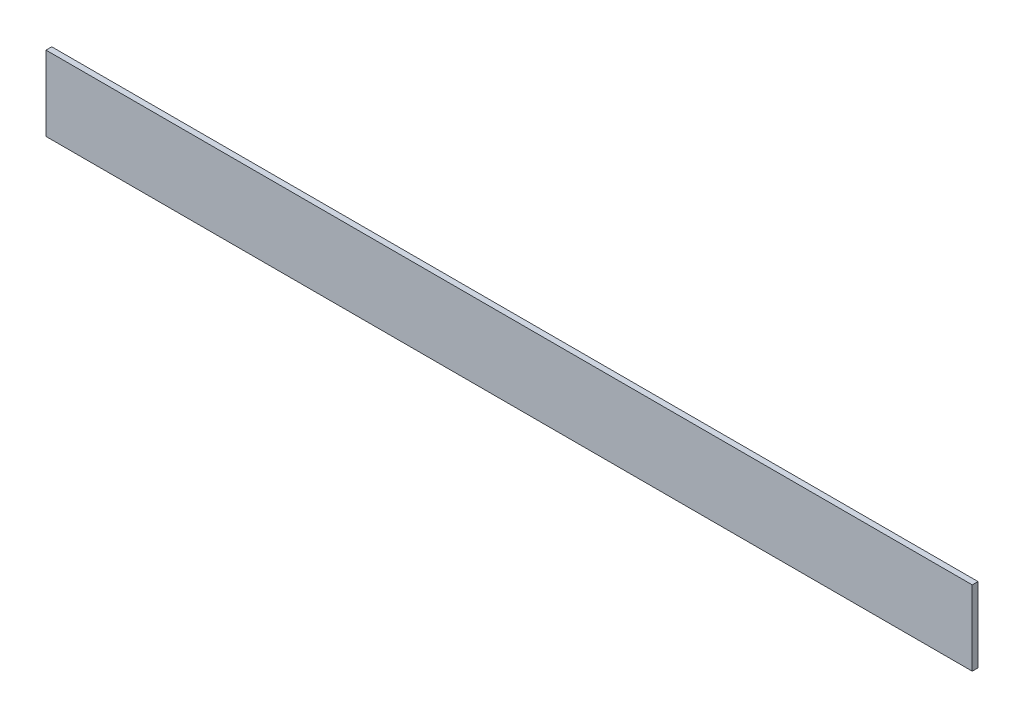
from build123d import *

# Parameters (mm, degrees)
SKETCH1_W           = 161
SKETCH1_H           = 13
BOSS_EXTRUDE1_DEPTH = 1


with BuildPart() as part:
    # Sketch1 → Boss-Extrude1 (new body)
    with BuildSketch(Plane.XY):
        with Locations((80.5, 6.5)):
            Rectangle(SKETCH1_W, SKETCH1_H)
    extrude(amount=BOSS_EXTRUDE1_DEPTH)


solid = part.part
